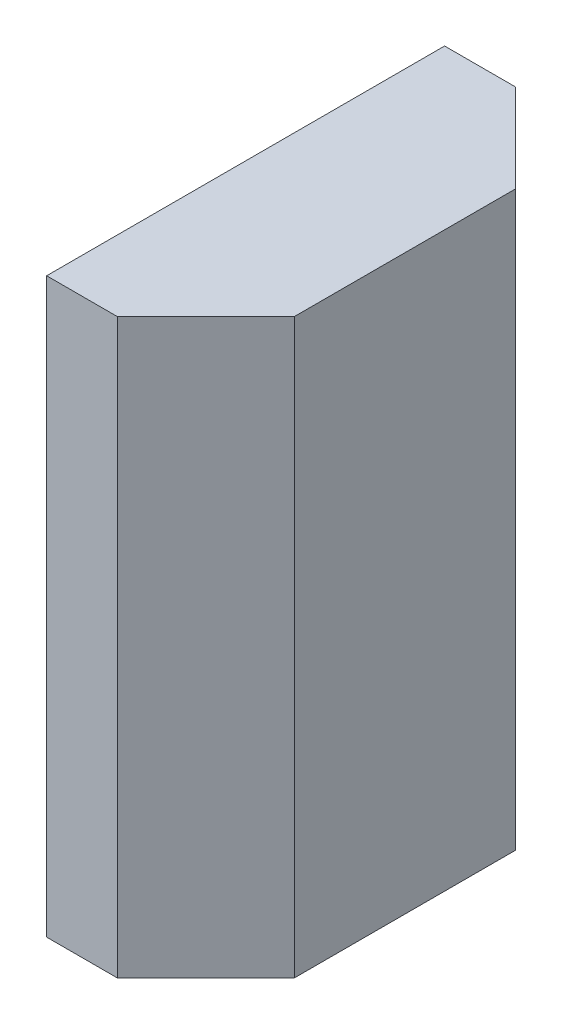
ISO-10303-21;
HEADER;
FILE_DESCRIPTION(('STEP AP214'),'2;1');
FILE_NAME('part.step','',(''),(''),'','','');
FILE_SCHEMA(('AUTOMOTIVE_DESIGN { 1 0 10303 214 1 1 1 1 }'));
ENDSEC;
DATA;
#1=APPLICATION_CONTEXT('core data for automotive mechanical design processes');
#2=APPLICATION_PROTOCOL_DEFINITION('international standard','automotive_design',2000,#1);
#3=PRODUCT_CONTEXT('',#1,'mechanical');
#4=PRODUCT('Part','Part','',(#3));
#5=PRODUCT_RELATED_PRODUCT_CATEGORY('part','',(#4));
#6=PRODUCT_DEFINITION_FORMATION('','',#4);
#7=PRODUCT_DEFINITION_CONTEXT('part definition',#1,'design');
#8=PRODUCT_DEFINITION('design','',#6,#7);
#9=PRODUCT_DEFINITION_SHAPE('','',#8);
#10=(LENGTH_UNIT() NAMED_UNIT(*) SI_UNIT(.MILLI.,.METRE.));
#11=(NAMED_UNIT(*) PLANE_ANGLE_UNIT() SI_UNIT($,.RADIAN.));
#12=(NAMED_UNIT(*) SI_UNIT($,.STERADIAN.) SOLID_ANGLE_UNIT());
#13=UNCERTAINTY_MEASURE_WITH_UNIT(LENGTH_MEASURE(1.E-05),#10,'distance_accuracy_value','');
#14=(GEOMETRIC_REPRESENTATION_CONTEXT(3) GLOBAL_UNCERTAINTY_ASSIGNED_CONTEXT((#13)) GLOBAL_UNIT_ASSIGNED_CONTEXT((#10,
#11,#12)) REPRESENTATION_CONTEXT('',''));
#15=CARTESIAN_POINT('',(0.,0.,0.));
#16=DIRECTION('',(0.,0.,1.));
#17=DIRECTION('',(1.,0.,0.));
#18=AXIS2_PLACEMENT_3D('',#15,#16,#17);
#19=CARTESIAN_POINT('',(6.35,0.,0.));
#20=DIRECTION('',(1.,0.,0.));
#21=DIRECTION('',(0.,0.,-1.));
#22=AXIS2_PLACEMENT_3D('',#19,#20,#21);
#23=PLANE('',#22);
#24=DIRECTION('',(0.,0.,-1.));
#25=VECTOR('',#24,1.);
#26=CARTESIAN_POINT('',(6.35,6.025,-2.286));
#27=LINE('',#26,#25);
#28=CARTESIAN_POINT('',(6.35,6.025,-13.97));
#29=VERTEX_POINT('',#28);
#30=CARTESIAN_POINT('',(6.35,6.025,-2.286));
#31=VERTEX_POINT('',#30);
#32=EDGE_CURVE('E476',#29,#31,#27,.F.);
#33=ORIENTED_EDGE('',*,*,#32,.F.);
#34=DIRECTION('',(0.,1.,0.));
#35=VECTOR('',#34,1.);
#36=CARTESIAN_POINT('',(6.35,-6.025,-13.97));
#37=LINE('',#36,#35);
#38=CARTESIAN_POINT('',(6.35,-6.025,-13.97));
#39=VERTEX_POINT('',#38);
#40=EDGE_CURVE('E218',#39,#29,#37,.T.);
#41=ORIENTED_EDGE('',*,*,#40,.F.);
#42=DIRECTION('',(0.,0.,1.));
#43=VECTOR('',#42,1.);
#44=CARTESIAN_POINT('',(6.35,-6.025,13.97));
#45=LINE('',#44,#43);
#46=CARTESIAN_POINT('',(6.35,-6.025,13.97));
#47=VERTEX_POINT('',#46);
#48=EDGE_CURVE('E42',#47,#39,#45,.F.);
#49=ORIENTED_EDGE('',*,*,#48,.F.);
#50=DIRECTION('',(0.,1.,0.));
#51=VECTOR('',#50,1.);
#52=CARTESIAN_POINT('',(6.35,-6.025,13.97));
#53=LINE('',#52,#51);
#54=CARTESIAN_POINT('',(6.35,6.025,13.97));
#55=VERTEX_POINT('',#54);
#56=EDGE_CURVE('E451',#55,#47,#53,.F.);
#57=ORIENTED_EDGE('',*,*,#56,.F.);
#58=DIRECTION('',(0.,0.,-1.));
#59=VECTOR('',#58,1.);
#60=CARTESIAN_POINT('',(6.35,6.025,13.97));
#61=LINE('',#60,#59);
#62=CARTESIAN_POINT('',(6.35,6.025,2.286));
#63=VERTEX_POINT('',#62);
#64=EDGE_CURVE('E456',#63,#55,#61,.F.);
#65=ORIENTED_EDGE('',*,*,#64,.F.);
#66=DIRECTION('',(0.,1.,0.));
#67=VECTOR('',#66,1.);
#68=CARTESIAN_POINT('',(6.35,6.025,2.286));
#69=LINE('',#68,#67);
#70=CARTESIAN_POINT('',(6.35,8.175,2.286));
#71=VERTEX_POINT('',#70);
#72=EDGE_CURVE('E461',#71,#63,#69,.F.);
#73=ORIENTED_EDGE('',*,*,#72,.F.);
#74=DIRECTION('',(0.,0.,-1.));
#75=VECTOR('',#74,1.);
#76=CARTESIAN_POINT('',(6.35,8.175,2.286));
#77=LINE('',#76,#75);
#78=CARTESIAN_POINT('',(6.35,8.175,-2.286));
#79=VERTEX_POINT('',#78);
#80=EDGE_CURVE('E466',#79,#71,#77,.F.);
#81=ORIENTED_EDGE('',*,*,#80,.F.);
#82=DIRECTION('',(0.,-1.,0.));
#83=VECTOR('',#82,1.);
#84=CARTESIAN_POINT('',(6.35,6.025,-2.286));
#85=LINE('',#84,#83);
#86=EDGE_CURVE('E471',#31,#79,#85,.F.);
#87=ORIENTED_EDGE('',*,*,#86,.F.);
#88=EDGE_LOOP('',(#33,#41,#49,#57,#65,#73,#81,#87));
#89=FACE_BOUND('',#88,.T.);
#90=ADVANCED_FACE('F39',(#89),#23,.F.);
#91=CARTESIAN_POINT('',(6.35,-6.025,13.97));
#92=DIRECTION('',(0.,1.,0.));
#93=DIRECTION('',(0.,0.,1.));
#94=AXIS2_PLACEMENT_3D('',#91,#92,#93);
#95=PLANE('',#94);
#96=ORIENTED_EDGE('',*,*,#48,.T.);
#97=DIRECTION('',(1.,0.,0.));
#98=VECTOR('',#97,1.);
#99=CARTESIAN_POINT('',(6.35,-6.025,-13.97));
#100=LINE('',#99,#98);
#101=CARTESIAN_POINT('',(0.,-6.025,-13.97));
#102=VERTEX_POINT('',#101);
#103=EDGE_CURVE('E480',#102,#39,#100,.T.);
#104=ORIENTED_EDGE('',*,*,#103,.F.);
#105=DIRECTION('',(0.,0.,1.));
#106=VECTOR('',#105,1.);
#107=CARTESIAN_POINT('',(0.,-6.025,0.));
#108=LINE('',#107,#106);
#109=CARTESIAN_POINT('',(0.,-6.025,13.97));
#110=VERTEX_POINT('',#109);
#111=EDGE_CURVE('E439',#110,#102,#108,.F.);
#112=ORIENTED_EDGE('',*,*,#111,.F.);
#113=DIRECTION('',(-1.,0.,0.));
#114=VECTOR('',#113,1.);
#115=CARTESIAN_POINT('',(6.35,-6.025,13.97));
#116=LINE('',#115,#114);
#117=EDGE_CURVE('E449',#47,#110,#116,.T.);
#118=ORIENTED_EDGE('',*,*,#117,.F.);
#119=EDGE_LOOP('',(#96,#104,#112,#118));
#120=FACE_BOUND('',#119,.T.);
#121=ADVANCED_FACE('F503',(#120),#95,.T.);
#122=CARTESIAN_POINT('',(6.35,-6.025,-13.97));
#123=DIRECTION('',(0.,0.,1.));
#124=DIRECTION('',(1.,0.,0.));
#125=AXIS2_PLACEMENT_3D('',#122,#123,#124);
#126=PLANE('',#125);
#127=ORIENTED_EDGE('',*,*,#40,.T.);
#128=DIRECTION('',(1.,0.,0.));
#129=VECTOR('',#128,1.);
#130=CARTESIAN_POINT('',(6.35,6.025,-13.97));
#131=LINE('',#130,#129);
#132=CARTESIAN_POINT('',(0.,6.025,-13.97));
#133=VERTEX_POINT('',#132);
#134=EDGE_CURVE('E478',#133,#29,#131,.T.);
#135=ORIENTED_EDGE('',*,*,#134,.F.);
#136=DIRECTION('',(0.,1.,0.));
#137=VECTOR('',#136,1.);
#138=CARTESIAN_POINT('',(0.,0.,-13.97));
#139=LINE('',#138,#137);
#140=EDGE_CURVE('E437',#102,#133,#139,.T.);
#141=ORIENTED_EDGE('',*,*,#140,.F.);
#142=ORIENTED_EDGE('',*,*,#103,.T.);
#143=EDGE_LOOP('',(#127,#135,#141,#142));
#144=FACE_BOUND('',#143,.T.);
#145=ADVANCED_FACE('F482',(#144),#126,.T.);
#146=CARTESIAN_POINT('',(6.35,6.025,-2.286));
#147=DIRECTION('',(0.,-1.,0.));
#148=DIRECTION('',(0.,0.,-1.));
#149=AXIS2_PLACEMENT_3D('',#146,#147,#148);
#150=PLANE('',#149);
#151=ORIENTED_EDGE('',*,*,#32,.T.);
#152=DIRECTION('',(1.,0.,0.));
#153=VECTOR('',#152,1.);
#154=CARTESIAN_POINT('',(6.35,6.025,-2.286));
#155=LINE('',#154,#153);
#156=CARTESIAN_POINT('',(0.,6.025,-2.286));
#157=VERTEX_POINT('',#156);
#158=EDGE_CURVE('E473',#157,#31,#155,.T.);
#159=ORIENTED_EDGE('',*,*,#158,.F.);
#160=DIRECTION('',(0.,0.,1.));
#161=VECTOR('',#160,1.);
#162=CARTESIAN_POINT('',(0.,6.025,0.));
#163=LINE('',#162,#161);
#164=EDGE_CURVE('E435',#133,#157,#163,.T.);
#165=ORIENTED_EDGE('',*,*,#164,.F.);
#166=ORIENTED_EDGE('',*,*,#134,.T.);
#167=EDGE_LOOP('',(#151,#159,#165,#166));
#168=FACE_BOUND('',#167,.T.);
#169=ADVANCED_FACE('F491',(#168),#150,.T.);
#170=CARTESIAN_POINT('',(6.35,6.025,-2.286));
#171=DIRECTION('',(0.,0.,1.));
#172=DIRECTION('',(0.,-1.,0.));
#173=AXIS2_PLACEMENT_3D('',#170,#171,#172);
#174=PLANE('',#173);
#175=ORIENTED_EDGE('',*,*,#86,.T.);
#176=DIRECTION('',(1.,0.,0.));
#177=VECTOR('',#176,1.);
#178=CARTESIAN_POINT('',(6.35,8.175,-2.286));
#179=LINE('',#178,#177);
#180=CARTESIAN_POINT('',(0.,8.175,-2.286));
#181=VERTEX_POINT('',#180);
#182=EDGE_CURVE('E468',#181,#79,#179,.T.);
#183=ORIENTED_EDGE('',*,*,#182,.F.);
#184=DIRECTION('',(0.,1.,0.));
#185=VECTOR('',#184,1.);
#186=CARTESIAN_POINT('',(0.,0.,-2.286));
#187=LINE('',#186,#185);
#188=EDGE_CURVE('E433',#157,#181,#187,.T.);
#189=ORIENTED_EDGE('',*,*,#188,.F.);
#190=ORIENTED_EDGE('',*,*,#158,.T.);
#191=EDGE_LOOP('',(#175,#183,#189,#190));
#192=FACE_BOUND('',#191,.T.);
#193=ADVANCED_FACE('F495',(#192),#174,.T.);
#194=CARTESIAN_POINT('',(6.35,8.175,2.286));
#195=DIRECTION('',(0.,-1.,0.));
#196=DIRECTION('',(0.,0.,-1.));
#197=AXIS2_PLACEMENT_3D('',#194,#195,#196);
#198=PLANE('',#197);
#199=ORIENTED_EDGE('',*,*,#80,.T.);
#200=DIRECTION('',(1.,0.,0.));
#201=VECTOR('',#200,1.);
#202=CARTESIAN_POINT('',(6.35,8.175,2.286));
#203=LINE('',#202,#201);
#204=CARTESIAN_POINT('',(0.,8.175,2.286));
#205=VERTEX_POINT('',#204);
#206=EDGE_CURVE('E463',#205,#71,#203,.T.);
#207=ORIENTED_EDGE('',*,*,#206,.F.);
#208=DIRECTION('',(0.,0.,1.));
#209=VECTOR('',#208,1.);
#210=CARTESIAN_POINT('',(0.,8.175,0.));
#211=LINE('',#210,#209);
#212=EDGE_CURVE('E431',#181,#205,#211,.T.);
#213=ORIENTED_EDGE('',*,*,#212,.F.);
#214=ORIENTED_EDGE('',*,*,#182,.T.);
#215=EDGE_LOOP('',(#199,#207,#213,#214));
#216=FACE_BOUND('',#215,.T.);
#217=ADVANCED_FACE('F517',(#216),#198,.T.);
#218=CARTESIAN_POINT('',(6.35,6.025,2.286));
#219=DIRECTION('',(0.,0.,-1.));
#220=DIRECTION('',(0.,1.,0.));
#221=AXIS2_PLACEMENT_3D('',#218,#219,#220);
#222=PLANE('',#221);
#223=ORIENTED_EDGE('',*,*,#72,.T.);
#224=DIRECTION('',(1.,0.,0.));
#225=VECTOR('',#224,1.);
#226=CARTESIAN_POINT('',(6.35,6.025,2.286));
#227=LINE('',#226,#225);
#228=CARTESIAN_POINT('',(0.,6.025,2.286));
#229=VERTEX_POINT('',#228);
#230=EDGE_CURVE('E458',#229,#63,#227,.T.);
#231=ORIENTED_EDGE('',*,*,#230,.F.);
#232=DIRECTION('',(0.,1.,0.));
#233=VECTOR('',#232,1.);
#234=CARTESIAN_POINT('',(0.,0.,2.286));
#235=LINE('',#234,#233);
#236=EDGE_CURVE('E429',#205,#229,#235,.F.);
#237=ORIENTED_EDGE('',*,*,#236,.F.);
#238=ORIENTED_EDGE('',*,*,#206,.T.);
#239=EDGE_LOOP('',(#223,#231,#237,#238));
#240=FACE_BOUND('',#239,.T.);
#241=ADVANCED_FACE('F515',(#240),#222,.T.);
#242=CARTESIAN_POINT('',(6.35,6.025,13.97));
#243=DIRECTION('',(0.,-1.,0.));
#244=DIRECTION('',(0.,0.,-1.));
#245=AXIS2_PLACEMENT_3D('',#242,#243,#244);
#246=PLANE('',#245);
#247=ORIENTED_EDGE('',*,*,#64,.T.);
#248=DIRECTION('',(-1.,0.,0.));
#249=VECTOR('',#248,1.);
#250=CARTESIAN_POINT('',(6.35,6.025,13.97));
#251=LINE('',#250,#249);
#252=CARTESIAN_POINT('',(0.,6.025,13.97));
#253=VERTEX_POINT('',#252);
#254=EDGE_CURVE('E453',#253,#55,#251,.F.);
#255=ORIENTED_EDGE('',*,*,#254,.F.);
#256=DIRECTION('',(0.,0.,1.));
#257=VECTOR('',#256,1.);
#258=CARTESIAN_POINT('',(0.,6.025,0.));
#259=LINE('',#258,#257);
#260=EDGE_CURVE('E427',#229,#253,#259,.T.);
#261=ORIENTED_EDGE('',*,*,#260,.F.);
#262=ORIENTED_EDGE('',*,*,#230,.T.);
#263=EDGE_LOOP('',(#247,#255,#261,#262));
#264=FACE_BOUND('',#263,.T.);
#265=ADVANCED_FACE('F510',(#264),#246,.T.);
#266=CARTESIAN_POINT('',(6.35,-6.025,13.97));
#267=DIRECTION('',(0.,0.,-1.));
#268=DIRECTION('',(-1.,0.,0.));
#269=AXIS2_PLACEMENT_3D('',#266,#267,#268);
#270=PLANE('',#269);
#271=ORIENTED_EDGE('',*,*,#56,.T.);
#272=ORIENTED_EDGE('',*,*,#117,.T.);
#273=DIRECTION('',(0.,1.,0.));
#274=VECTOR('',#273,1.);
#275=CARTESIAN_POINT('',(0.,0.,13.97));
#276=LINE('',#275,#274);
#277=EDGE_CURVE('E424',#253,#110,#276,.F.);
#278=ORIENTED_EDGE('',*,*,#277,.F.);
#279=ORIENTED_EDGE('',*,*,#254,.T.);
#280=EDGE_LOOP('',(#271,#272,#278,#279));
#281=FACE_BOUND('',#280,.T.);
#282=ADVANCED_FACE('F505',(#281),#270,.T.);
#283=CARTESIAN_POINT('',(0.,-4.25,0.));
#284=DIRECTION('',(0.,1.,0.));
#285=DIRECTION('',(0.,0.,1.));
#286=AXIS2_PLACEMENT_3D('',#283,#284,#285);
#287=PLANE('',#286);
#288=DIRECTION('',(-1.,0.,0.));
#289=VECTOR('',#288,1.);
#290=CARTESIAN_POINT('',(0.,-4.25,-15.97));
#291=LINE('',#290,#289);
#292=CARTESIAN_POINT('',(1.79999999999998,-4.25,-15.97));
#293=VERTEX_POINT('',#292);
#294=CARTESIAN_POINT('',(0.,-4.24999999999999,-15.97));
#295=VERTEX_POINT('',#294);
#296=EDGE_CURVE('E409',#293,#295,#291,.T.);
#297=ORIENTED_EDGE('',*,*,#296,.T.);
#298=DIRECTION('',(0.,0.,1.));
#299=VECTOR('',#298,1.);
#300=CARTESIAN_POINT('',(0.,-4.24999999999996,0.));
#301=LINE('',#300,#299);
#302=CARTESIAN_POINT('',(0.,-4.25,-14.97));
#303=VERTEX_POINT('',#302);
#304=EDGE_CURVE('E418',#303,#295,#301,.F.);
#305=ORIENTED_EDGE('',*,*,#304,.F.);
#306=DIRECTION('',(1.,0.,0.));
#307=VECTOR('',#306,1.);
#308=CARTESIAN_POINT('',(0.,-4.25,-14.97));
#309=LINE('',#308,#307);
#310=CARTESIAN_POINT('',(0.799999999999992,-4.25,-14.97));
#311=VERTEX_POINT('',#310);
#312=EDGE_CURVE('E444',#303,#311,#309,.T.);
#313=ORIENTED_EDGE('',*,*,#312,.T.);
#314=DIRECTION('',(-0.707106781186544,0.,0.707106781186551));
#315=VECTOR('',#314,1.);
#316=CARTESIAN_POINT('',(2.,-4.25,-16.17));
#317=LINE('',#316,#315);
#318=EDGE_CURVE('E422',#293,#311,#317,.T.);
#319=ORIENTED_EDGE('',*,*,#318,.F.);
#320=EDGE_LOOP('',(#297,#305,#313,#319));
#321=FACE_BOUND('',#320,.T.);
#322=ADVANCED_FACE('F616',(#321),#287,.T.);
#323=CARTESIAN_POINT('',(24.35,0.,12.5));
#324=DIRECTION('',(0.707106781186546,0.,0.707106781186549));
#325=DIRECTION('',(0.707106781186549,0.,-0.707106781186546));
#326=AXIS2_PLACEMENT_3D('',#323,#324,#325);
#327=PLANE('',#326);
#328=DIRECTION('',(0.,1.,0.));
#329=VECTOR('',#328,1.);
#330=CARTESIAN_POINT('',(14.35,31.75,22.5));
#331=LINE('',#330,#329);
#332=CARTESIAN_POINT('',(14.35,31.75,22.5));
#333=VERTEX_POINT('',#332);
#334=CARTESIAN_POINT('',(14.35,-33.02,22.5));
#335=VERTEX_POINT('',#334);
#336=EDGE_CURVE('E393',#333,#335,#331,.F.);
#337=ORIENTED_EDGE('',*,*,#336,.T.);
#338=DIRECTION('',(0.707106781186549,0.,-0.707106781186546));
#339=VECTOR('',#338,1.);
#340=CARTESIAN_POINT('',(14.35,-33.02,22.5));
#341=LINE('',#340,#339);
#342=CARTESIAN_POINT('',(24.35,-33.02,12.5));
#343=VERTEX_POINT('',#342);
#344=EDGE_CURVE('E270',#335,#343,#341,.T.);
#345=ORIENTED_EDGE('',*,*,#344,.T.);
#346=DIRECTION('',(0.,1.,0.));
#347=VECTOR('',#346,1.);
#348=CARTESIAN_POINT('',(24.35,0.,12.5));
#349=LINE('',#348,#347);
#350=CARTESIAN_POINT('',(24.35,31.75,12.5));
#351=VERTEX_POINT('',#350);
#352=EDGE_CURVE('E447',#351,#343,#349,.F.);
#353=ORIENTED_EDGE('',*,*,#352,.F.);
#354=DIRECTION('',(-0.707106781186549,0.,0.707106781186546));
#355=VECTOR('',#354,1.);
#356=CARTESIAN_POINT('',(24.35,31.75,12.5));
#357=LINE('',#356,#355);
#358=EDGE_CURVE('E402',#351,#333,#357,.T.);
#359=ORIENTED_EDGE('',*,*,#358,.T.);
#360=EDGE_LOOP('',(#337,#345,#353,#359));
#361=FACE_BOUND('',#360,.T.);
#362=ADVANCED_FACE('F612',(#361),#327,.T.);
#363=CARTESIAN_POINT('',(24.35,0.,0.));
#364=DIRECTION('',(1.,0.,0.));
#365=DIRECTION('',(0.,0.,-1.));
#366=AXIS2_PLACEMENT_3D('',#363,#364,#365);
#367=PLANE('',#366);
#368=ORIENTED_EDGE('',*,*,#352,.T.);
#369=DIRECTION('',(0.,0.,-1.));
#370=VECTOR('',#369,1.);
#371=CARTESIAN_POINT('',(24.35,-33.02,12.5));
#372=LINE('',#371,#370);
#373=CARTESIAN_POINT('',(24.35,-33.02,-12.5));
#374=VERTEX_POINT('',#373);
#375=EDGE_CURVE('E277',#343,#374,#372,.T.);
#376=ORIENTED_EDGE('',*,*,#375,.T.);
#377=DIRECTION('',(0.,1.,0.));
#378=VECTOR('',#377,1.);
#379=CARTESIAN_POINT('',(24.35,0.,-12.5));
#380=LINE('',#379,#378);
#381=CARTESIAN_POINT('',(24.35,31.75,-12.5));
#382=VERTEX_POINT('',#381);
#383=EDGE_CURVE('E407',#382,#374,#380,.F.);
#384=ORIENTED_EDGE('',*,*,#383,.F.);
#385=DIRECTION('',(0.,0.,-1.));
#386=VECTOR('',#385,1.);
#387=CARTESIAN_POINT('',(24.35,31.75,22.5));
#388=LINE('',#387,#386);
#389=EDGE_CURVE('E396',#382,#351,#388,.F.);
#390=ORIENTED_EDGE('',*,*,#389,.T.);
#391=EDGE_LOOP('',(#368,#376,#384,#390));
#392=FACE_BOUND('',#391,.T.);
#393=ADVANCED_FACE('F608',(#392),#367,.T.);
#394=CARTESIAN_POINT('',(0.,-4.25,-14.97));
#395=DIRECTION('',(0.,0.,1.));
#396=DIRECTION('',(1.,0.,0.));
#397=AXIS2_PLACEMENT_3D('',#394,#395,#396);
#398=PLANE('',#397);
#399=DIRECTION('',(0.,1.,0.));
#400=VECTOR('',#399,1.);
#401=CARTESIAN_POINT('',(0.799999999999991,-4.25,-14.97));
#402=LINE('',#401,#400);
#403=CARTESIAN_POINT('',(0.79999999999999,10.2229819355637,-14.97));
#404=VERTEX_POINT('',#403);
#405=EDGE_CURVE('E420',#311,#404,#402,.T.);
#406=ORIENTED_EDGE('',*,*,#405,.F.);
#407=ORIENTED_EDGE('',*,*,#312,.F.);
#408=DIRECTION('',(0.,1.,0.));
#409=VECTOR('',#408,1.);
#410=CARTESIAN_POINT('',(0.,0.,-14.97));
#411=LINE('',#410,#409);
#412=CARTESIAN_POINT('',(0.,8.02499999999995,-14.97));
#413=VERTEX_POINT('',#412);
#414=EDGE_CURVE('E441',#413,#303,#411,.F.);
#415=ORIENTED_EDGE('',*,*,#414,.F.);
#416=DIRECTION('',(-0.342020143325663,-0.93969262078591,0.));
#417=VECTOR('',#416,1.);
#418=CARTESIAN_POINT('',(6.35,25.4714816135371,-14.97));
#419=LINE('',#418,#417);
#420=EDGE_CURVE('E342',#404,#413,#419,.T.);
#421=ORIENTED_EDGE('',*,*,#420,.F.);
#422=EDGE_LOOP('',(#406,#407,#415,#421));
#423=FACE_BOUND('',#422,.T.);
#424=ADVANCED_FACE('F605',(#423),#398,.F.);
#425=CARTESIAN_POINT('',(0.,0.,0.));
#426=DIRECTION('',(-1.,0.,0.));
#427=DIRECTION('',(0.,0.,1.));
#428=AXIS2_PLACEMENT_3D('',#425,#426,#427);
#429=PLANE('',#428);
#430=ORIENTED_EDGE('',*,*,#260,.T.);
#431=ORIENTED_EDGE('',*,*,#277,.T.);
#432=ORIENTED_EDGE('',*,*,#111,.T.);
#433=ORIENTED_EDGE('',*,*,#140,.T.);
#434=ORIENTED_EDGE('',*,*,#164,.T.);
#435=ORIENTED_EDGE('',*,*,#188,.T.);
#436=ORIENTED_EDGE('',*,*,#212,.T.);
#437=ORIENTED_EDGE('',*,*,#236,.T.);
#438=EDGE_LOOP('',(#430,#431,#432,#433,#434,#435,#436,#437));
#439=FACE_BOUND('',#438,.T.);
#440=DIRECTION('',(0.,-1.,0.));
#441=VECTOR('',#440,1.);
#442=CARTESIAN_POINT('',(0.,8.025,-4.286));
#443=LINE('',#442,#441);
#444=CARTESIAN_POINT('',(0.,10.175,-4.28599999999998));
#445=VERTEX_POINT('',#444);
#446=CARTESIAN_POINT('',(0.,8.02499999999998,-4.286));
#447=VERTEX_POINT('',#446);
#448=EDGE_CURVE('E347',#445,#447,#443,.T.);
#449=ORIENTED_EDGE('',*,*,#448,.T.);
#450=DIRECTION('',(0.,0.,1.));
#451=VECTOR('',#450,1.);
#452=CARTESIAN_POINT('',(0.,8.02499999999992,0.));
#453=LINE('',#452,#451);
#454=EDGE_CURVE('E340',#413,#447,#453,.T.);
#455=ORIENTED_EDGE('',*,*,#454,.F.);
#456=ORIENTED_EDGE('',*,*,#414,.T.);
#457=DIRECTION('',(0.,0.,1.));
#458=VECTOR('',#457,1.);
#459=CARTESIAN_POINT('',(0.,-4.24999999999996,0.));
#460=LINE('',#459,#458);
#461=CARTESIAN_POINT('',(0.,-4.24999999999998,-14.5));
#462=VERTEX_POINT('',#461);
#463=EDGE_CURVE('E415',#462,#303,#460,.F.);
#464=ORIENTED_EDGE('',*,*,#463,.F.);
#465=DIRECTION('',(0.,1.,0.));
#466=VECTOR('',#465,1.);
#467=CARTESIAN_POINT('',(0.,-12.25,-14.5));
#468=LINE('',#467,#466);
#469=CARTESIAN_POINT('',(0.,-8.025,-14.5));
#470=VERTEX_POINT('',#469);
#471=EDGE_CURVE('E379',#462,#470,#468,.F.);
#472=ORIENTED_EDGE('',*,*,#471,.T.);
#473=DIRECTION('',(0.,0.,1.));
#474=VECTOR('',#473,1.);
#475=CARTESIAN_POINT('',(0.,-8.025,15.97));
#476=LINE('',#475,#474);
#477=CARTESIAN_POINT('',(0.,-8.025,15.97));
#478=VERTEX_POINT('',#477);
#479=EDGE_CURVE('E377',#470,#478,#476,.T.);
#480=ORIENTED_EDGE('',*,*,#479,.T.);
#481=DIRECTION('',(0.,1.,0.));
#482=VECTOR('',#481,1.);
#483=CARTESIAN_POINT('',(0.,-8.025,15.97));
#484=LINE('',#483,#482);
#485=CARTESIAN_POINT('',(0.,8.025,15.97));
#486=VERTEX_POINT('',#485);
#487=EDGE_CURVE('E368',#478,#486,#484,.T.);
#488=ORIENTED_EDGE('',*,*,#487,.T.);
#489=DIRECTION('',(0.,0.,1.));
#490=VECTOR('',#489,1.);
#491=CARTESIAN_POINT('',(0.,8.02499999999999,0.));
#492=LINE('',#491,#490);
#493=CARTESIAN_POINT('',(0.,8.025,4.28600000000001));
#494=VERTEX_POINT('',#493);
#495=EDGE_CURVE('E366',#494,#486,#492,.T.);
#496=ORIENTED_EDGE('',*,*,#495,.F.);
#497=DIRECTION('',(0.,1.,0.));
#498=VECTOR('',#497,1.);
#499=CARTESIAN_POINT('',(0.,8.025,4.286));
#500=LINE('',#499,#498);
#501=CARTESIAN_POINT('',(0.,10.175,4.286));
#502=VERTEX_POINT('',#501);
#503=EDGE_CURVE('E357',#494,#502,#500,.T.);
#504=ORIENTED_EDGE('',*,*,#503,.T.);
#505=DIRECTION('',(0.,0.,1.));
#506=VECTOR('',#505,1.);
#507=CARTESIAN_POINT('',(0.,10.175,0.));
#508=LINE('',#507,#506);
#509=EDGE_CURVE('E355',#445,#502,#508,.T.);
#510=ORIENTED_EDGE('',*,*,#509,.F.);
#511=EDGE_LOOP('',(#449,#455,#456,#464,#472,#480,#488,#496,#504,#510));
#512=FACE_BOUND('',#511,.T.);
#513=ADVANCED_FACE('F499',(#439,#512),#429,.T.);
#514=CARTESIAN_POINT('',(2.,-4.25,-16.17));
#515=DIRECTION('',(-0.707106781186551,0.,-0.707106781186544));
#516=DIRECTION('',(-0.707106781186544,0.,0.707106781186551));
#517=AXIS2_PLACEMENT_3D('',#514,#515,#516);
#518=PLANE('',#517);
#519=DIRECTION('',(0.,1.,0.));
#520=VECTOR('',#519,1.);
#521=CARTESIAN_POINT('',(1.79999999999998,-8.025,-15.97));
#522=LINE('',#521,#520);
#523=CARTESIAN_POINT('',(1.79999999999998,12.9704593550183,-15.97));
#524=VERTEX_POINT('',#523);
#525=CARTESIAN_POINT('',(1.79999999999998,-2.44999999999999,-15.97));
#526=VERTEX_POINT('',#525);
#527=EDGE_CURVE('E332',#524,#526,#522,.F.);
#528=ORIENTED_EDGE('',*,*,#527,.T.);
#529=DIRECTION('',(0.,1.,0.));
#530=VECTOR('',#529,1.);
#531=CARTESIAN_POINT('',(1.79999999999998,-4.25,-15.97));
#532=LINE('',#531,#530);
#533=EDGE_CURVE('E412',#526,#293,#532,.F.);
#534=ORIENTED_EDGE('',*,*,#533,.T.);
#535=ORIENTED_EDGE('',*,*,#318,.T.);
#536=ORIENTED_EDGE('',*,*,#405,.T.);
#537=DIRECTION('',(-0.32361557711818,-0.889126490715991,0.323615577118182));
#538=VECTOR('',#537,1.);
#539=CARTESIAN_POINT('',(1.79999999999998,12.9704593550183,-15.97));
#540=LINE('',#539,#538);
#541=EDGE_CURVE('E344',#524,#404,#540,.T.);
#542=ORIENTED_EDGE('',*,*,#541,.F.);
#543=EDGE_LOOP('',(#528,#534,#535,#536,#542));
#544=FACE_BOUND('',#543,.T.);
#545=ADVANCED_FACE('F598',(#544),#518,.T.);
#546=CARTESIAN_POINT('',(0.,-4.25,-15.97));
#547=DIRECTION('',(0.,0.,-1.));
#548=DIRECTION('',(-1.,0.,0.));
#549=AXIS2_PLACEMENT_3D('',#546,#547,#548);
#550=PLANE('',#549);
#551=ORIENTED_EDGE('',*,*,#533,.F.);
#552=DIRECTION('',(-0.707106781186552,-0.707106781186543,0.));
#553=VECTOR('',#552,1.);
#554=CARTESIAN_POINT('',(0.,-4.25,-15.97));
#555=LINE('',#554,#553);
#556=EDGE_CURVE('E327',#295,#526,#555,.F.);
#557=ORIENTED_EDGE('',*,*,#556,.F.);
#558=ORIENTED_EDGE('',*,*,#296,.F.);
#559=EDGE_LOOP('',(#551,#557,#558));
#560=FACE_BOUND('',#559,.T.);
#561=ADVANCED_FACE('F594',(#560),#550,.F.);
#562=CARTESIAN_POINT('',(24.35,0.,-12.5));
#563=DIRECTION('',(0.707106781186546,0.,-0.707106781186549));
#564=DIRECTION('',(-0.707106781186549,0.,-0.707106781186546));
#565=AXIS2_PLACEMENT_3D('',#562,#563,#564);
#566=PLANE('',#565);
#567=ORIENTED_EDGE('',*,*,#383,.T.);
#568=DIRECTION('',(-0.707106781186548,0.,-0.707106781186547));
#569=VECTOR('',#568,1.);
#570=CARTESIAN_POINT('',(24.35,-33.02,-12.5));
#571=LINE('',#570,#569);
#572=CARTESIAN_POINT('',(14.35,-33.02,-22.5));
#573=VERTEX_POINT('',#572);
#574=EDGE_CURVE('E280',#374,#573,#571,.T.);
#575=ORIENTED_EDGE('',*,*,#574,.T.);
#576=DIRECTION('',(0.,1.,0.));
#577=VECTOR('',#576,1.);
#578=CARTESIAN_POINT('',(14.35,31.75,-22.5));
#579=LINE('',#578,#577);
#580=CARTESIAN_POINT('',(14.35,31.75,-22.5));
#581=VERTEX_POINT('',#580);
#582=EDGE_CURVE('E237',#573,#581,#579,.T.);
#583=ORIENTED_EDGE('',*,*,#582,.T.);
#584=DIRECTION('',(0.707106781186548,0.,0.707106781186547));
#585=VECTOR('',#584,1.);
#586=CARTESIAN_POINT('',(14.35,31.75,-22.5));
#587=LINE('',#586,#585);
#588=EDGE_CURVE('E399',#581,#382,#587,.T.);
#589=ORIENTED_EDGE('',*,*,#588,.T.);
#590=EDGE_LOOP('',(#567,#575,#583,#589));
#591=FACE_BOUND('',#590,.T.);
#592=ADVANCED_FACE('F590',(#591),#566,.T.);
#593=CARTESIAN_POINT('',(-1.2180000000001,0.,0.));
#594=DIRECTION('',(-1.,0.,0.));
#595=DIRECTION('',(0.,0.,1.));
#596=AXIS2_PLACEMENT_3D('',#593,#594,#595);
#597=PLANE('',#596);
#598=DIRECTION('',(0.,1.,0.));
#599=VECTOR('',#598,1.);
#600=CARTESIAN_POINT('',(-1.2180000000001,31.75,-22.5));
#601=LINE('',#600,#599);
#602=CARTESIAN_POINT('',(-1.2180000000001,-5.46799999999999,-22.5));
#603=VERTEX_POINT('',#602);
#604=CARTESIAN_POINT('',(-1.2180000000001,-12.25,-22.5));
#605=VERTEX_POINT('',#604);
#606=EDGE_CURVE('E317',#603,#605,#601,.F.);
#607=ORIENTED_EDGE('',*,*,#606,.T.);
#608=DIRECTION('',(0.,0.,1.));
#609=VECTOR('',#608,1.);
#610=CARTESIAN_POINT('',(-1.2180000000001,-12.25,-14.5));
#611=LINE('',#610,#609);
#612=CARTESIAN_POINT('',(-1.2180000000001,-12.25,-14.5));
#613=VERTEX_POINT('',#612);
#614=EDGE_CURVE('E391',#605,#613,#611,.T.);
#615=ORIENTED_EDGE('',*,*,#614,.T.);
#616=DIRECTION('',(0.,1.,0.));
#617=VECTOR('',#616,1.);
#618=CARTESIAN_POINT('',(-1.2180000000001,-12.25,-14.5));
#619=LINE('',#618,#617);
#620=CARTESIAN_POINT('',(-1.2180000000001,-5.46799999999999,-14.5));
#621=VERTEX_POINT('',#620);
#622=EDGE_CURVE('E385',#613,#621,#619,.T.);
#623=ORIENTED_EDGE('',*,*,#622,.T.);
#624=DIRECTION('',(0.,0.,1.));
#625=VECTOR('',#624,1.);
#626=CARTESIAN_POINT('',(-1.2180000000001,-5.46799999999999,0.));
#627=LINE('',#626,#625);
#628=EDGE_CURVE('E404',#621,#603,#627,.F.);
#629=ORIENTED_EDGE('',*,*,#628,.T.);
#630=EDGE_LOOP('',(#607,#615,#623,#629));
#631=FACE_BOUND('',#630,.T.);
#632=ADVANCED_FACE('F586',(#631),#597,.T.);
#633=CARTESIAN_POINT('',(24.35,31.75,22.5));
#634=DIRECTION('',(0.,-1.,0.));
#635=DIRECTION('',(0.,0.,-1.));
#636=AXIS2_PLACEMENT_3D('',#633,#634,#635);
#637=PLANE('',#636);
#638=ORIENTED_EDGE('',*,*,#588,.F.);
#639=DIRECTION('',(1.,0.,0.));
#640=VECTOR('',#639,1.);
#641=CARTESIAN_POINT('',(24.35,31.75,-22.5));
#642=LINE('',#641,#640);
#643=CARTESIAN_POINT('',(6.35,31.75,-22.5));
#644=VERTEX_POINT('',#643);
#645=EDGE_CURVE('E321',#581,#644,#642,.F.);
#646=ORIENTED_EDGE('',*,*,#645,.T.);
#647=DIRECTION('',(0.,0.,-1.));
#648=VECTOR('',#647,1.);
#649=CARTESIAN_POINT('',(6.35,31.75,0.));
#650=LINE('',#649,#648);
#651=CARTESIAN_POINT('',(6.35,31.75,22.5));
#652=VERTEX_POINT('',#651);
#653=EDGE_CURVE('E261',#644,#652,#650,.F.);
#654=ORIENTED_EDGE('',*,*,#653,.T.);
#655=DIRECTION('',(1.,0.,0.));
#656=VECTOR('',#655,1.);
#657=CARTESIAN_POINT('',(24.35,31.75,22.5));
#658=LINE('',#657,#656);
#659=EDGE_CURVE('E259',#652,#333,#658,.T.);
#660=ORIENTED_EDGE('',*,*,#659,.T.);
#661=ORIENTED_EDGE('',*,*,#358,.F.);
#662=ORIENTED_EDGE('',*,*,#389,.F.);
#663=EDGE_LOOP('',(#638,#646,#654,#660,#661,#662));
#664=FACE_BOUND('',#663,.T.);
#665=ADVANCED_FACE('F583',(#664),#637,.F.);
#666=CARTESIAN_POINT('',(24.35,31.75,22.5));
#667=DIRECTION('',(0.,0.,-1.));
#668=DIRECTION('',(0.,1.,0.));
#669=AXIS2_PLACEMENT_3D('',#666,#667,#668);
#670=PLANE('',#669);
#671=DIRECTION('',(0.,1.,0.));
#672=VECTOR('',#671,1.);
#673=CARTESIAN_POINT('',(6.35,0.,22.5));
#674=LINE('',#673,#672);
#675=CARTESIAN_POINT('',(6.35,-33.02,22.5));
#676=VERTEX_POINT('',#675);
#677=EDGE_CURVE('E253',#652,#676,#674,.F.);
#678=ORIENTED_EDGE('',*,*,#677,.T.);
#679=DIRECTION('',(1.,0.,0.));
#680=VECTOR('',#679,1.);
#681=CARTESIAN_POINT('',(6.35,-33.02,22.5));
#682=LINE('',#681,#680);
#683=EDGE_CURVE('E257',#676,#335,#682,.T.);
#684=ORIENTED_EDGE('',*,*,#683,.T.);
#685=ORIENTED_EDGE('',*,*,#336,.F.);
#686=ORIENTED_EDGE('',*,*,#659,.F.);
#687=EDGE_LOOP('',(#678,#684,#685,#686));
#688=FACE_BOUND('',#687,.T.);
#689=ADVANCED_FACE('F255',(#688),#670,.F.);
#690=CARTESIAN_POINT('',(-1.2180000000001,-12.25,-14.5));
#691=DIRECTION('',(0.,1.,0.));
#692=DIRECTION('',(0.,0.,1.));
#693=AXIS2_PLACEMENT_3D('',#690,#691,#692);
#694=PLANE('',#693);
#695=DIRECTION('',(1.,0.,0.));
#696=VECTOR('',#695,1.);
#697=CARTESIAN_POINT('',(-1.2180000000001,-12.25,-14.5));
#698=LINE('',#697,#696);
#699=CARTESIAN_POINT('',(6.35,-12.25,-14.5));
#700=VERTEX_POINT('',#699);
#701=EDGE_CURVE('E388',#700,#613,#698,.F.);
#702=ORIENTED_EDGE('',*,*,#701,.T.);
#703=ORIENTED_EDGE('',*,*,#614,.F.);
#704=DIRECTION('',(1.,0.,0.));
#705=VECTOR('',#704,1.);
#706=CARTESIAN_POINT('',(24.35,-12.25,-22.5));
#707=LINE('',#706,#705);
#708=CARTESIAN_POINT('',(6.35,-12.25,-22.5));
#709=VERTEX_POINT('',#708);
#710=EDGE_CURVE('E325',#605,#709,#707,.T.);
#711=ORIENTED_EDGE('',*,*,#710,.T.);
#712=DIRECTION('',(0.,0.,-1.));
#713=VECTOR('',#712,1.);
#714=CARTESIAN_POINT('',(6.35,-12.25,0.));
#715=LINE('',#714,#713);
#716=EDGE_CURVE('E312',#709,#700,#715,.F.);
#717=ORIENTED_EDGE('',*,*,#716,.T.);
#718=EDGE_LOOP('',(#702,#703,#711,#717));
#719=FACE_BOUND('',#718,.T.);
#720=ADVANCED_FACE('F576',(#719),#694,.F.);
#721=CARTESIAN_POINT('',(-1.2180000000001,-12.25,-14.5));
#722=DIRECTION('',(0.,0.,-1.));
#723=DIRECTION('',(0.,1.,0.));
#724=AXIS2_PLACEMENT_3D('',#721,#722,#723);
#725=PLANE('',#724);
#726=DIRECTION('',(0.707106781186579,0.707106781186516,0.));
#727=VECTOR('',#726,1.);
#728=CARTESIAN_POINT('',(-1.2180000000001,-5.46799999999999,-14.5));
#729=LINE('',#728,#727);
#730=EDGE_CURVE('E382',#621,#462,#729,.T.);
#731=ORIENTED_EDGE('',*,*,#730,.F.);
#732=ORIENTED_EDGE('',*,*,#622,.F.);
#733=ORIENTED_EDGE('',*,*,#701,.F.);
#734=DIRECTION('',(0.,1.,0.));
#735=VECTOR('',#734,1.);
#736=CARTESIAN_POINT('',(6.35,0.,-14.5));
#737=LINE('',#736,#735);
#738=CARTESIAN_POINT('',(6.35,-8.025,-14.5));
#739=VERTEX_POINT('',#738);
#740=EDGE_CURVE('E309',#700,#739,#737,.T.);
#741=ORIENTED_EDGE('',*,*,#740,.T.);
#742=DIRECTION('',(1.,0.,0.));
#743=VECTOR('',#742,1.);
#744=CARTESIAN_POINT('',(6.35,-8.025,-14.5));
#745=LINE('',#744,#743);
#746=EDGE_CURVE('E374',#739,#470,#745,.F.);
#747=ORIENTED_EDGE('',*,*,#746,.T.);
#748=ORIENTED_EDGE('',*,*,#471,.F.);
#749=EDGE_LOOP('',(#731,#732,#733,#741,#747,#748));
#750=FACE_BOUND('',#749,.T.);
#751=ADVANCED_FACE('F572',(#750),#725,.F.);
#752=CARTESIAN_POINT('',(6.35,-8.025,15.97));
#753=DIRECTION('',(0.,1.,0.));
#754=DIRECTION('',(0.,0.,1.));
#755=AXIS2_PLACEMENT_3D('',#752,#753,#754);
#756=PLANE('',#755);
#757=DIRECTION('',(0.,0.,-1.));
#758=VECTOR('',#757,1.);
#759=CARTESIAN_POINT('',(6.35,-8.025,0.));
#760=LINE('',#759,#758);
#761=CARTESIAN_POINT('',(6.35,-8.025,15.97));
#762=VERTEX_POINT('',#761);
#763=EDGE_CURVE('E306',#739,#762,#760,.F.);
#764=ORIENTED_EDGE('',*,*,#763,.T.);
#765=DIRECTION('',(-1.,0.,0.));
#766=VECTOR('',#765,1.);
#767=CARTESIAN_POINT('',(6.35,-8.025,15.97));
#768=LINE('',#767,#766);
#769=EDGE_CURVE('E371',#762,#478,#768,.T.);
#770=ORIENTED_EDGE('',*,*,#769,.T.);
#771=ORIENTED_EDGE('',*,*,#479,.F.);
#772=ORIENTED_EDGE('',*,*,#746,.F.);
#773=EDGE_LOOP('',(#764,#770,#771,#772));
#774=FACE_BOUND('',#773,.T.);
#775=ADVANCED_FACE('F568',(#774),#756,.F.);
#776=CARTESIAN_POINT('',(6.35,-8.025,15.97));
#777=DIRECTION('',(0.,0.,-1.));
#778=DIRECTION('',(-1.,0.,0.));
#779=AXIS2_PLACEMENT_3D('',#776,#777,#778);
#780=PLANE('',#779);
#781=ORIENTED_EDGE('',*,*,#769,.F.);
#782=DIRECTION('',(0.,1.,0.));
#783=VECTOR('',#782,1.);
#784=CARTESIAN_POINT('',(6.35,0.,15.97));
#785=LINE('',#784,#783);
#786=CARTESIAN_POINT('',(6.35,25.4714816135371,15.97));
#787=VERTEX_POINT('',#786);
#788=EDGE_CURVE('E304',#762,#787,#785,.T.);
#789=ORIENTED_EDGE('',*,*,#788,.T.);
#790=DIRECTION('',(-0.342020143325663,-0.93969262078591,0.));
#791=VECTOR('',#790,1.);
#792=CARTESIAN_POINT('',(6.35,25.4714816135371,15.97));
#793=LINE('',#792,#791);
#794=EDGE_CURVE('E363',#486,#787,#793,.F.);
#795=ORIENTED_EDGE('',*,*,#794,.F.);
#796=ORIENTED_EDGE('',*,*,#487,.F.);
#797=EDGE_LOOP('',(#781,#789,#795,#796));
#798=FACE_BOUND('',#797,.T.);
#799=ADVANCED_FACE('F564',(#798),#780,.F.);
#800=CARTESIAN_POINT('',(6.35,25.4714816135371,0.));
#801=DIRECTION('',(-0.93969262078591,0.342020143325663,0.));
#802=DIRECTION('',(-0.342020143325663,-0.93969262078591,0.));
#803=AXIS2_PLACEMENT_3D('',#800,#801,#802);
#804=PLANE('',#803);
#805=ORIENTED_EDGE('',*,*,#794,.T.);
#806=DIRECTION('',(0.,0.,-1.));
#807=VECTOR('',#806,1.);
#808=CARTESIAN_POINT('',(6.35,25.4714816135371,0.));
#809=LINE('',#808,#807);
#810=CARTESIAN_POINT('',(6.35,25.4714816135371,4.28600000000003));
#811=VERTEX_POINT('',#810);
#812=EDGE_CURVE('E301',#787,#811,#809,.T.);
#813=ORIENTED_EDGE('',*,*,#812,.T.);
#814=DIRECTION('',(-0.342020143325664,-0.93969262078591,0.));
#815=VECTOR('',#814,1.);
#816=CARTESIAN_POINT('',(6.35,25.4714816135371,4.28600000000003));
#817=LINE('',#816,#815);
#818=EDGE_CURVE('E360',#811,#494,#817,.T.);
#819=ORIENTED_EDGE('',*,*,#818,.T.);
#820=ORIENTED_EDGE('',*,*,#495,.T.);
#821=EDGE_LOOP('',(#805,#813,#819,#820));
#822=FACE_BOUND('',#821,.T.);
#823=ADVANCED_FACE('F560',(#822),#804,.T.);
#824=CARTESIAN_POINT('',(6.35,8.025,4.286));
#825=DIRECTION('',(0.,0.,-1.));
#826=DIRECTION('',(0.,1.,0.));
#827=AXIS2_PLACEMENT_3D('',#824,#825,#826);
#828=PLANE('',#827);
#829=ORIENTED_EDGE('',*,*,#818,.F.);
#830=DIRECTION('',(0.,1.,0.));
#831=VECTOR('',#830,1.);
#832=CARTESIAN_POINT('',(6.35,0.,4.28600000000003));
#833=LINE('',#832,#831);
#834=CARTESIAN_POINT('',(6.35,27.6214816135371,4.28600000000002));
#835=VERTEX_POINT('',#834);
#836=EDGE_CURVE('E298',#811,#835,#833,.T.);
#837=ORIENTED_EDGE('',*,*,#836,.T.);
#838=DIRECTION('',(-0.342020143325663,-0.93969262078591,0.));
#839=VECTOR('',#838,1.);
#840=CARTESIAN_POINT('',(6.35,27.6214816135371,4.286));
#841=LINE('',#840,#839);
#842=EDGE_CURVE('E353',#502,#835,#841,.F.);
#843=ORIENTED_EDGE('',*,*,#842,.F.);
#844=ORIENTED_EDGE('',*,*,#503,.F.);
#845=EDGE_LOOP('',(#829,#837,#843,#844));
#846=FACE_BOUND('',#845,.T.);
#847=ADVANCED_FACE('F556',(#846),#828,.F.);
#848=CARTESIAN_POINT('',(6.35,27.6214816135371,0.));
#849=DIRECTION('',(-0.93969262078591,0.342020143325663,0.));
#850=DIRECTION('',(-0.342020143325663,-0.93969262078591,0.));
#851=AXIS2_PLACEMENT_3D('',#848,#849,#850);
#852=PLANE('',#851);
#853=ORIENTED_EDGE('',*,*,#842,.T.);
#854=DIRECTION('',(0.,0.,-1.));
#855=VECTOR('',#854,1.);
#856=CARTESIAN_POINT('',(6.35,27.6214816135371,0.));
#857=LINE('',#856,#855);
#858=CARTESIAN_POINT('',(6.35,27.6214816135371,-4.28599999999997));
#859=VERTEX_POINT('',#858);
#860=EDGE_CURVE('E295',#835,#859,#857,.T.);
#861=ORIENTED_EDGE('',*,*,#860,.T.);
#862=DIRECTION('',(-0.342020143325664,-0.93969262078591,0.));
#863=VECTOR('',#862,1.);
#864=CARTESIAN_POINT('',(6.35,27.6214816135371,-4.28599999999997));
#865=LINE('',#864,#863);
#866=EDGE_CURVE('E350',#859,#445,#865,.T.);
#867=ORIENTED_EDGE('',*,*,#866,.T.);
#868=ORIENTED_EDGE('',*,*,#509,.T.);
#869=EDGE_LOOP('',(#853,#861,#867,#868));
#870=FACE_BOUND('',#869,.T.);
#871=ADVANCED_FACE('F552',(#870),#852,.T.);
#872=CARTESIAN_POINT('',(6.35,8.025,-4.286));
#873=DIRECTION('',(0.,0.,1.));
#874=DIRECTION('',(0.,-1.,0.));
#875=AXIS2_PLACEMENT_3D('',#872,#873,#874);
#876=PLANE('',#875);
#877=DIRECTION('',(-0.342020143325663,-0.93969262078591,0.));
#878=VECTOR('',#877,1.);
#879=CARTESIAN_POINT('',(6.35,25.4714816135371,-4.286));
#880=LINE('',#879,#878);
#881=CARTESIAN_POINT('',(6.35,25.4714816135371,-4.28599999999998));
#882=VERTEX_POINT('',#881);
#883=EDGE_CURVE('E338',#447,#882,#880,.F.);
#884=ORIENTED_EDGE('',*,*,#883,.F.);
#885=ORIENTED_EDGE('',*,*,#448,.F.);
#886=ORIENTED_EDGE('',*,*,#866,.F.);
#887=DIRECTION('',(0.,1.,0.));
#888=VECTOR('',#887,1.);
#889=CARTESIAN_POINT('',(6.35,0.,-4.28599999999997));
#890=LINE('',#889,#888);
#891=EDGE_CURVE('E292',#859,#882,#890,.F.);
#892=ORIENTED_EDGE('',*,*,#891,.T.);
#893=EDGE_LOOP('',(#884,#885,#886,#892));
#894=FACE_BOUND('',#893,.T.);
#895=ADVANCED_FACE('F548',(#894),#876,.F.);
#896=CARTESIAN_POINT('',(6.35,25.4714816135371,0.));
#897=DIRECTION('',(-0.93969262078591,0.342020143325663,0.));
#898=DIRECTION('',(-0.342020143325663,-0.93969262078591,0.));
#899=AXIS2_PLACEMENT_3D('',#896,#897,#898);
#900=PLANE('',#899);
#901=ORIENTED_EDGE('',*,*,#883,.T.);
#902=DIRECTION('',(0.,0.,-1.));
#903=VECTOR('',#902,1.);
#904=CARTESIAN_POINT('',(6.35,25.4714816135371,0.));
#905=LINE('',#904,#903);
#906=CARTESIAN_POINT('',(6.35,25.4714816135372,-15.97));
#907=VERTEX_POINT('',#906);
#908=EDGE_CURVE('E289',#882,#907,#905,.T.);
#909=ORIENTED_EDGE('',*,*,#908,.T.);
#910=DIRECTION('',(-0.342020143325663,-0.93969262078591,0.));
#911=VECTOR('',#910,1.);
#912=CARTESIAN_POINT('',(6.35,25.4714816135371,-15.97));
#913=LINE('',#912,#911);
#914=EDGE_CURVE('E335',#907,#524,#913,.T.);
#915=ORIENTED_EDGE('',*,*,#914,.T.);
#916=ORIENTED_EDGE('',*,*,#541,.T.);
#917=ORIENTED_EDGE('',*,*,#420,.T.);
#918=ORIENTED_EDGE('',*,*,#454,.T.);
#919=EDGE_LOOP('',(#901,#909,#915,#916,#917,#918));
#920=FACE_BOUND('',#919,.T.);
#921=ADVANCED_FACE('F544',(#920),#900,.T.);
#922=CARTESIAN_POINT('',(6.35,-8.025,-15.97));
#923=DIRECTION('',(0.,0.,1.));
#924=DIRECTION('',(1.,0.,0.));
#925=AXIS2_PLACEMENT_3D('',#922,#923,#924);
#926=PLANE('',#925);
#927=ORIENTED_EDGE('',*,*,#527,.F.);
#928=ORIENTED_EDGE('',*,*,#914,.F.);
#929=DIRECTION('',(0.,1.,0.));
#930=VECTOR('',#929,1.);
#931=CARTESIAN_POINT('',(6.35,0.,-15.97));
#932=LINE('',#931,#930);
#933=CARTESIAN_POINT('',(6.35,2.09999999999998,-15.97));
#934=VERTEX_POINT('',#933);
#935=EDGE_CURVE('E286',#907,#934,#932,.F.);
#936=ORIENTED_EDGE('',*,*,#935,.T.);
#937=DIRECTION('',(-0.707106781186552,-0.707106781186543,0.));
#938=VECTOR('',#937,1.);
#939=CARTESIAN_POINT('',(0.,-4.25,-15.97));
#940=LINE('',#939,#938);
#941=EDGE_CURVE('E330',#526,#934,#940,.F.);
#942=ORIENTED_EDGE('',*,*,#941,.F.);
#943=EDGE_LOOP('',(#927,#928,#936,#942));
#944=FACE_BOUND('',#943,.T.);
#945=ADVANCED_FACE('F540',(#944),#926,.F.);
#946=CARTESIAN_POINT('',(0.,-4.25,-14.5));
#947=DIRECTION('',(-0.707106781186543,0.707106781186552,0.));
#948=DIRECTION('',(-0.707106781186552,-0.707106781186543,0.));
#949=AXIS2_PLACEMENT_3D('',#946,#947,#948);
#950=PLANE('',#949);
#951=DIRECTION('',(-0.707106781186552,-0.707106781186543,0.));
#952=VECTOR('',#951,1.);
#953=CARTESIAN_POINT('',(6.35,2.09999999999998,-22.5));
#954=LINE('',#953,#952);
#955=CARTESIAN_POINT('',(6.35,2.09999999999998,-22.5));
#956=VERTEX_POINT('',#955);
#957=EDGE_CURVE('E56',#956,#603,#954,.T.);
#958=ORIENTED_EDGE('',*,*,#957,.T.);
#959=ORIENTED_EDGE('',*,*,#628,.F.);
#960=ORIENTED_EDGE('',*,*,#730,.T.);
#961=ORIENTED_EDGE('',*,*,#463,.T.);
#962=ORIENTED_EDGE('',*,*,#304,.T.);
#963=ORIENTED_EDGE('',*,*,#556,.T.);
#964=ORIENTED_EDGE('',*,*,#941,.T.);
#965=DIRECTION('',(0.,0.,-1.));
#966=VECTOR('',#965,1.);
#967=CARTESIAN_POINT('',(6.35,2.09999999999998,0.));
#968=LINE('',#967,#966);
#969=EDGE_CURVE('E48',#934,#956,#968,.T.);
#970=ORIENTED_EDGE('',*,*,#969,.T.);
#971=EDGE_LOOP('',(#958,#959,#960,#961,#962,#963,#964,#970));
#972=FACE_BOUND('',#971,.T.);
#973=ADVANCED_FACE('F535',(#972),#950,.T.);
#974=CARTESIAN_POINT('',(24.35,31.75,-22.5));
#975=DIRECTION('',(0.,0.,1.));
#976=DIRECTION('',(1.,0.,0.));
#977=AXIS2_PLACEMENT_3D('',#974,#975,#976);
#978=PLANE('',#977);
#979=DIRECTION('',(0.,1.,0.));
#980=VECTOR('',#979,1.);
#981=CARTESIAN_POINT('',(6.35,0.,-22.5));
#982=LINE('',#981,#980);
#983=CARTESIAN_POINT('',(6.35,-33.02,-22.5));
#984=VERTEX_POINT('',#983);
#985=EDGE_CURVE('E231',#984,#709,#982,.T.);
#986=ORIENTED_EDGE('',*,*,#985,.T.);
#987=ORIENTED_EDGE('',*,*,#710,.F.);
#988=ORIENTED_EDGE('',*,*,#606,.F.);
#989=ORIENTED_EDGE('',*,*,#957,.F.);
#990=DIRECTION('',(0.,1.,0.));
#991=VECTOR('',#990,1.);
#992=CARTESIAN_POINT('',(6.35,0.,-22.5));
#993=LINE('',#992,#991);
#994=EDGE_CURVE('E11',#956,#644,#993,.T.);
#995=ORIENTED_EDGE('',*,*,#994,.T.);
#996=ORIENTED_EDGE('',*,*,#645,.F.);
#997=ORIENTED_EDGE('',*,*,#582,.F.);
#998=DIRECTION('',(-1.,0.,0.));
#999=VECTOR('',#998,1.);
#1000=CARTESIAN_POINT('',(14.35,-33.02,-22.5));
#1001=LINE('',#1000,#999);
#1002=EDGE_CURVE('E282',#573,#984,#1001,.T.);
#1003=ORIENTED_EDGE('',*,*,#1002,.T.);
#1004=EDGE_LOOP('',(#986,#987,#988,#989,#995,#996,#997,#1003));
#1005=FACE_BOUND('',#1004,.T.);
#1006=ADVANCED_FACE('F528',(#1005),#978,.F.);
#1007=CARTESIAN_POINT('',(6.35,0.,0.));
#1008=DIRECTION('',(1.,0.,0.));
#1009=DIRECTION('',(0.,0.,-1.));
#1010=AXIS2_PLACEMENT_3D('',#1007,#1008,#1009);
#1011=PLANE('',#1010);
#1012=ORIENTED_EDGE('',*,*,#812,.F.);
#1013=ORIENTED_EDGE('',*,*,#788,.F.);
#1014=ORIENTED_EDGE('',*,*,#763,.F.);
#1015=ORIENTED_EDGE('',*,*,#740,.F.);
#1016=ORIENTED_EDGE('',*,*,#716,.F.);
#1017=ORIENTED_EDGE('',*,*,#985,.F.);
#1018=DIRECTION('',(0.,0.,1.));
#1019=VECTOR('',#1018,1.);
#1020=CARTESIAN_POINT('',(6.35,-33.02,-22.5));
#1021=LINE('',#1020,#1019);
#1022=EDGE_CURVE('E267',#984,#676,#1021,.T.);
#1023=ORIENTED_EDGE('',*,*,#1022,.T.);
#1024=ORIENTED_EDGE('',*,*,#677,.F.);
#1025=ORIENTED_EDGE('',*,*,#653,.F.);
#1026=ORIENTED_EDGE('',*,*,#994,.F.);
#1027=ORIENTED_EDGE('',*,*,#969,.F.);
#1028=ORIENTED_EDGE('',*,*,#935,.F.);
#1029=ORIENTED_EDGE('',*,*,#908,.F.);
#1030=ORIENTED_EDGE('',*,*,#891,.F.);
#1031=ORIENTED_EDGE('',*,*,#860,.F.);
#1032=ORIENTED_EDGE('',*,*,#836,.F.);
#1033=EDGE_LOOP('',(#1012,#1013,#1014,#1015,#1016,#1017,#1023,#1024,#1025,#1026,#1027,#1028,
#1029,#1030,#1031,#1032));
#1034=FACE_BOUND('',#1033,.T.);
#1035=ADVANCED_FACE('F273',(#1034),#1011,.F.);
#1036=CARTESIAN_POINT('',(0.,-33.02,0.));
#1037=DIRECTION('',(0.,1.,0.));
#1038=DIRECTION('',(0.,0.,1.));
#1039=AXIS2_PLACEMENT_3D('',#1036,#1037,#1038);
#1040=PLANE('',#1039);
#1041=ORIENTED_EDGE('',*,*,#1022,.F.);
#1042=ORIENTED_EDGE('',*,*,#1002,.F.);
#1043=ORIENTED_EDGE('',*,*,#574,.F.);
#1044=ORIENTED_EDGE('',*,*,#375,.F.);
#1045=ORIENTED_EDGE('',*,*,#344,.F.);
#1046=ORIENTED_EDGE('',*,*,#683,.F.);
#1047=EDGE_LOOP('',(#1041,#1042,#1043,#1044,#1045,#1046));
#1048=FACE_BOUND('',#1047,.T.);
#1049=ADVANCED_FACE('F265',(#1048),#1040,.F.);
#1050=CLOSED_SHELL('',(#90,#121,#145,#169,#193,#217,#241,#265,#282,#322,#362,#393,#424,#513,
#545,#561,#592,#632,#665,#689,#720,#751,#775,#799,#823,#847,#871,#895,#921,#945,#973,#1006,
#1035,#1049));
#1051=MANIFOLD_SOLID_BREP('B2',#1050);
#1052=ADVANCED_BREP_SHAPE_REPRESENTATION('',(#18,#1051),#14);
#1053=SHAPE_DEFINITION_REPRESENTATION(#9,#1052);
ENDSEC;
END-ISO-10303-21;
